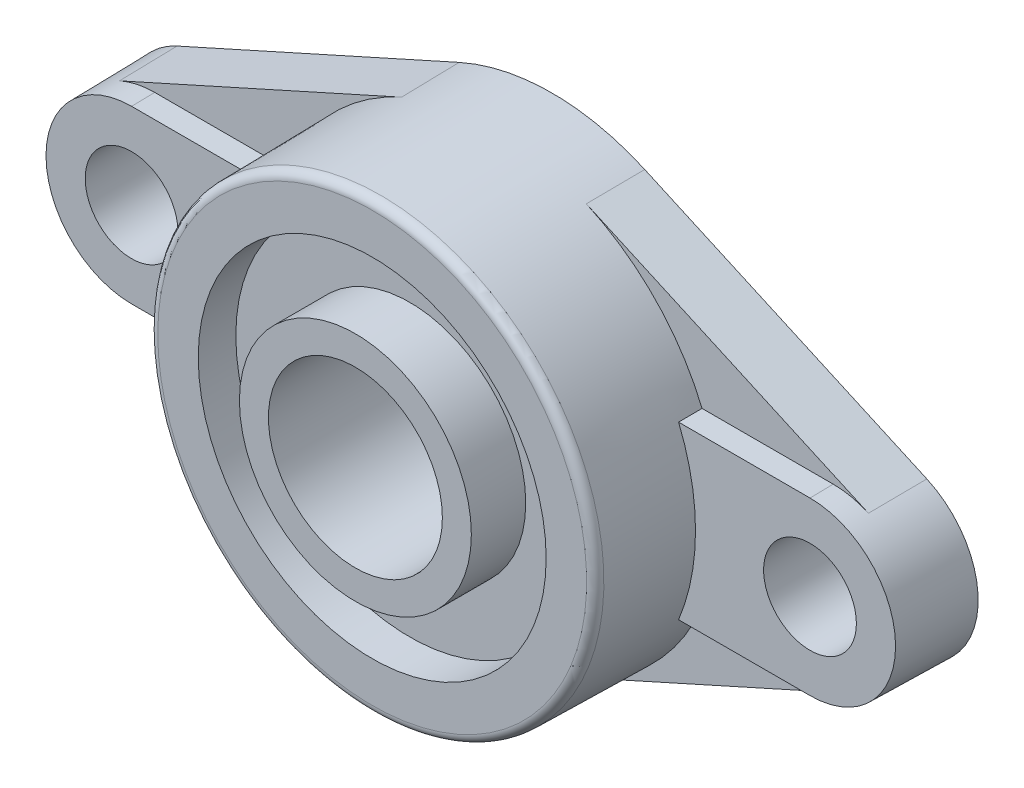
ISO-10303-21;
HEADER;
FILE_DESCRIPTION(('STEP AP214'),'2;1');
FILE_NAME('part.step','',(''),(''),'','','');
FILE_SCHEMA(('AUTOMOTIVE_DESIGN { 1 0 10303 214 1 1 1 1 }'));
ENDSEC;
DATA;
#1=APPLICATION_CONTEXT('core data for automotive mechanical design processes');
#2=APPLICATION_PROTOCOL_DEFINITION('international standard','automotive_design',2000,#1);
#3=PRODUCT_CONTEXT('',#1,'mechanical');
#4=PRODUCT('Part','Part','',(#3));
#5=PRODUCT_RELATED_PRODUCT_CATEGORY('part','',(#4));
#6=PRODUCT_DEFINITION_FORMATION('','',#4);
#7=PRODUCT_DEFINITION_CONTEXT('part definition',#1,'design');
#8=PRODUCT_DEFINITION('design','',#6,#7);
#9=PRODUCT_DEFINITION_SHAPE('','',#8);
#10=(LENGTH_UNIT() NAMED_UNIT(*) SI_UNIT(.MILLI.,.METRE.));
#11=(NAMED_UNIT(*) PLANE_ANGLE_UNIT() SI_UNIT($,.RADIAN.));
#12=(NAMED_UNIT(*) SI_UNIT($,.STERADIAN.) SOLID_ANGLE_UNIT());
#13=UNCERTAINTY_MEASURE_WITH_UNIT(LENGTH_MEASURE(1.E-05),#10,'distance_accuracy_value','');
#14=(GEOMETRIC_REPRESENTATION_CONTEXT(3) GLOBAL_UNCERTAINTY_ASSIGNED_CONTEXT((#13)) GLOBAL_UNIT_ASSIGNED_CONTEXT((#10,
#11,#12)) REPRESENTATION_CONTEXT('',''));
#15=CARTESIAN_POINT('',(0.,0.,0.));
#16=DIRECTION('',(0.,0.,1.));
#17=DIRECTION('',(1.,0.,0.));
#18=AXIS2_PLACEMENT_3D('',#15,#16,#17);
#19=CARTESIAN_POINT('',(0.,15.,33.9));
#20=DIRECTION('',(0.,0.,1.));
#21=DIRECTION('',(1.,0.,0.));
#22=AXIS2_PLACEMENT_3D('',#19,#20,#21);
#23=PLANE('',#22);
#24=CARTESIAN_POINT('',(0.,0.,33.9));
#25=DIRECTION('',(0.,0.,-1.));
#26=DIRECTION('',(-1.,0.,0.));
#27=AXIS2_PLACEMENT_3D('',#24,#25,#26);
#28=CIRCLE('',#27,20.);
#29=CARTESIAN_POINT('',(-20.,0.,33.9));
#30=VERTEX_POINT('',#29);
#31=EDGE_CURVE('E373',#30,#30,#28,.T.);
#32=ORIENTED_EDGE('',*,*,#31,.F.);
#33=EDGE_LOOP('',(#32));
#34=FACE_BOUND('',#33,.T.);
#35=CARTESIAN_POINT('',(0.,0.,33.9));
#36=DIRECTION('',(0.,0.,-1.));
#37=DIRECTION('',(1.,0.,0.));
#38=AXIS2_PLACEMENT_3D('',#35,#36,#37);
#39=CIRCLE('',#38,15.);
#40=CARTESIAN_POINT('',(15.,0.,33.9));
#41=VERTEX_POINT('',#40);
#42=EDGE_CURVE('E465',#41,#41,#39,.T.);
#43=ORIENTED_EDGE('',*,*,#42,.T.);
#44=EDGE_LOOP('',(#43));
#45=FACE_BOUND('',#44,.T.);
#46=ADVANCED_FACE('F17',(#34,#45),#23,.T.);
#47=CARTESIAN_POINT('',(0.,15.,-4.09999999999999));
#48=DIRECTION('',(0.,0.,1.));
#49=DIRECTION('',(1.,0.,0.));
#50=AXIS2_PLACEMENT_3D('',#47,#48,#49);
#51=PLANE('',#50);
#52=CARTESIAN_POINT('',(0.,0.,-4.09999999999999));
#53=DIRECTION('',(0.,0.,-1.));
#54=DIRECTION('',(-1.,0.,0.));
#55=AXIS2_PLACEMENT_3D('',#52,#53,#54);
#56=CIRCLE('',#55,20.);
#57=CARTESIAN_POINT('',(-20.,0.,-4.09999999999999));
#58=VERTEX_POINT('',#57);
#59=EDGE_CURVE('E291',#58,#58,#56,.T.);
#60=ORIENTED_EDGE('',*,*,#59,.T.);
#61=EDGE_LOOP('',(#60));
#62=FACE_BOUND('',#61,.T.);
#63=CARTESIAN_POINT('',(0.,0.,-4.09999999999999));
#64=DIRECTION('',(0.,0.,1.));
#65=DIRECTION('',(1.,0.,0.));
#66=AXIS2_PLACEMENT_3D('',#63,#64,#65);
#67=CIRCLE('',#66,15.);
#68=CARTESIAN_POINT('',(15.,0.,-4.09999999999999));
#69=VERTEX_POINT('',#68);
#70=EDGE_CURVE('E462',#69,#69,#67,.F.);
#71=ORIENTED_EDGE('',*,*,#70,.F.);
#72=EDGE_LOOP('',(#71));
#73=FACE_BOUND('',#72,.T.);
#74=ADVANCED_FACE('F415',(#62,#73),#51,.F.);
#75=CARTESIAN_POINT('',(-58.5,0.,10.));
#76=DIRECTION('',(0.,0.,-1.));
#77=DIRECTION('',(-1.,0.,0.));
#78=AXIS2_PLACEMENT_3D('',#75,#76,#77);
#79=PLANE('',#78);
#80=CARTESIAN_POINT('',(0.,0.,10.));
#81=DIRECTION('',(0.,0.,-1.));
#82=DIRECTION('',(-1.,0.,0.));
#83=AXIS2_PLACEMENT_3D('',#80,#81,#82);
#84=CIRCLE('',#83,38.8254493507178);
#85=CARTESIAN_POINT('',(-15.9283894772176,-35.4076534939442,10.));
#86=VERTEX_POINT('',#85);
#87=CARTESIAN_POINT('',(-35.8834442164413,-14.8254493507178,10.));
#88=VERTEX_POINT('',#87);
#89=EDGE_CURVE('E290',#86,#88,#84,.T.);
#90=ORIENTED_EDGE('',*,*,#89,.T.);
#91=DIRECTION('',(-1.,0.,0.));
#92=VECTOR('',#91,1.);
#93=CARTESIAN_POINT('',(-58.5,-14.8254493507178,10.));
#94=LINE('',#93,#92);
#95=CARTESIAN_POINT('',(-58.5,-14.8254493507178,10.));
#96=VERTEX_POINT('',#95);
#97=EDGE_CURVE('E269',#88,#96,#94,.T.);
#98=ORIENTED_EDGE('',*,*,#97,.T.);
#99=CARTESIAN_POINT('',(-58.5,0.,10.));
#100=DIRECTION('',(0.,0.,-1.));
#101=DIRECTION('',(-1.,0.,0.));
#102=AXIS2_PLACEMENT_3D('',#99,#100,#101);
#103=CIRCLE('',#102,14.8254493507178);
#104=CARTESIAN_POINT('',(-64.5822356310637,-13.5203682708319,10.));
#105=VERTEX_POINT('',#104);
#106=EDGE_CURVE('E138',#96,#105,#103,.T.);
#107=ORIENTED_EDGE('',*,*,#106,.T.);
#108=DIRECTION('',(-0.911970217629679,0.41025641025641,0.));
#109=VECTOR('',#108,1.);
#110=CARTESIAN_POINT('',(-64.5822356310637,-13.5203682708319,10.));
#111=LINE('',#110,#109);
#112=EDGE_CURVE('E249',#86,#105,#111,.T.);
#113=ORIENTED_EDGE('',*,*,#112,.F.);
#114=EDGE_LOOP('',(#90,#98,#107,#113));
#115=FACE_BOUND('',#114,.T.);
#116=ADVANCED_FACE('F370',(#115),#79,.F.);
#117=CARTESIAN_POINT('',(0.,0.,10.));
#118=DIRECTION('',(0.,0.,-1.));
#119=DIRECTION('',(-1.,0.,0.));
#120=AXIS2_PLACEMENT_3D('',#117,#118,#119);
#121=CIRCLE('',#120,38.8254493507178);
#122=CARTESIAN_POINT('',(35.8834442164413,-14.8254493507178,10.));
#123=VERTEX_POINT('',#122);
#124=CARTESIAN_POINT('',(15.9283894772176,-35.4076534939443,10.));
#125=VERTEX_POINT('',#124);
#126=EDGE_CURVE('E263',#123,#125,#121,.T.);
#127=ORIENTED_EDGE('',*,*,#126,.T.);
#128=DIRECTION('',(-0.911970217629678,-0.410256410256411,0.));
#129=VECTOR('',#128,1.);
#130=CARTESIAN_POINT('',(-32.7254566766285,-57.2949387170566,10.));
#131=LINE('',#130,#129);
#132=CARTESIAN_POINT('',(64.5822356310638,-13.5203682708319,10.));
#133=VERTEX_POINT('',#132);
#134=EDGE_CURVE('E273',#133,#125,#131,.T.);
#135=ORIENTED_EDGE('',*,*,#134,.F.);
#136=CARTESIAN_POINT('',(58.5,0.,10.));
#137=DIRECTION('',(0.,0.,-1.));
#138=DIRECTION('',(-1.,0.,0.));
#139=AXIS2_PLACEMENT_3D('',#136,#137,#138);
#140=CIRCLE('',#139,14.8254493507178);
#141=CARTESIAN_POINT('',(58.5,-14.8254493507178,10.));
#142=VERTEX_POINT('',#141);
#143=EDGE_CURVE('E297',#133,#142,#140,.T.);
#144=ORIENTED_EDGE('',*,*,#143,.T.);
#145=DIRECTION('',(-1.,0.,0.));
#146=VECTOR('',#145,1.);
#147=CARTESIAN_POINT('',(-58.5,-14.8254493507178,10.));
#148=LINE('',#147,#146);
#149=EDGE_CURVE('E310',#142,#123,#148,.T.);
#150=ORIENTED_EDGE('',*,*,#149,.T.);
#151=EDGE_LOOP('',(#127,#135,#144,#150));
#152=FACE_BOUND('',#151,.T.);
#153=ADVANCED_FACE('F328',(#152),#79,.F.);
#154=CARTESIAN_POINT('',(0.,0.,10.));
#155=DIRECTION('',(0.,0.,-1.));
#156=DIRECTION('',(-1.,0.,0.));
#157=AXIS2_PLACEMENT_3D('',#154,#155,#156);
#158=CIRCLE('',#157,38.8254493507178);
#159=CARTESIAN_POINT('',(15.9283894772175,35.4076534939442,10.));
#160=VERTEX_POINT('',#159);
#161=CARTESIAN_POINT('',(35.8834442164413,14.8254493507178,10.));
#162=VERTEX_POINT('',#161);
#163=EDGE_CURVE('E34',#160,#162,#158,.T.);
#164=ORIENTED_EDGE('',*,*,#163,.T.);
#165=DIRECTION('',(1.,0.,0.));
#166=VECTOR('',#165,1.);
#167=CARTESIAN_POINT('',(-58.5,14.8254493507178,10.));
#168=LINE('',#167,#166);
#169=CARTESIAN_POINT('',(58.5,14.8254493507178,10.));
#170=VERTEX_POINT('',#169);
#171=EDGE_CURVE('E243',#162,#170,#168,.T.);
#172=ORIENTED_EDGE('',*,*,#171,.T.);
#173=CARTESIAN_POINT('',(58.5,0.,10.));
#174=DIRECTION('',(0.,0.,-1.));
#175=DIRECTION('',(-1.,0.,0.));
#176=AXIS2_PLACEMENT_3D('',#173,#174,#175);
#177=CIRCLE('',#176,14.8254493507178);
#178=CARTESIAN_POINT('',(64.5822356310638,13.5203682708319,10.));
#179=VERTEX_POINT('',#178);
#180=EDGE_CURVE('E146',#170,#179,#177,.T.);
#181=ORIENTED_EDGE('',*,*,#180,.T.);
#182=DIRECTION('',(0.911970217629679,-0.41025641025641,0.));
#183=VECTOR('',#182,1.);
#184=CARTESIAN_POINT('',(-32.7254566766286,57.2949387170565,10.));
#185=LINE('',#184,#183);
#186=EDGE_CURVE('E270',#160,#179,#185,.T.);
#187=ORIENTED_EDGE('',*,*,#186,.F.);
#188=EDGE_LOOP('',(#164,#172,#181,#187));
#189=FACE_BOUND('',#188,.T.);
#190=ADVANCED_FACE('F345',(#189),#79,.F.);
#191=CARTESIAN_POINT('',(0.,0.,10.));
#192=DIRECTION('',(0.,0.,-1.));
#193=DIRECTION('',(-1.,0.,0.));
#194=AXIS2_PLACEMENT_3D('',#191,#192,#193);
#195=CIRCLE('',#194,38.8254493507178);
#196=CARTESIAN_POINT('',(-35.8834442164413,14.8254493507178,10.));
#197=VERTEX_POINT('',#196);
#198=CARTESIAN_POINT('',(-15.9283894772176,35.4076534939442,10.));
#199=VERTEX_POINT('',#198);
#200=EDGE_CURVE('E288',#197,#199,#195,.T.);
#201=ORIENTED_EDGE('',*,*,#200,.T.);
#202=DIRECTION('',(0.911970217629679,0.41025641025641,0.));
#203=VECTOR('',#202,1.);
#204=CARTESIAN_POINT('',(-64.5822356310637,13.5203682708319,10.));
#205=LINE('',#204,#203);
#206=CARTESIAN_POINT('',(-64.5822356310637,13.5203682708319,10.));
#207=VERTEX_POINT('',#206);
#208=EDGE_CURVE('E274',#207,#199,#205,.T.);
#209=ORIENTED_EDGE('',*,*,#208,.F.);
#210=CARTESIAN_POINT('',(-58.5,0.,10.));
#211=DIRECTION('',(0.,0.,-1.));
#212=DIRECTION('',(-1.,0.,0.));
#213=AXIS2_PLACEMENT_3D('',#210,#211,#212);
#214=CIRCLE('',#213,14.8254493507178);
#215=CARTESIAN_POINT('',(-58.5,14.8254493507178,10.));
#216=VERTEX_POINT('',#215);
#217=EDGE_CURVE('E245',#207,#216,#214,.T.);
#218=ORIENTED_EDGE('',*,*,#217,.T.);
#219=DIRECTION('',(1.,0.,0.));
#220=VECTOR('',#219,1.);
#221=CARTESIAN_POINT('',(-58.5,14.8254493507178,10.));
#222=LINE('',#221,#220);
#223=EDGE_CURVE('E266',#216,#197,#222,.T.);
#224=ORIENTED_EDGE('',*,*,#223,.T.);
#225=EDGE_LOOP('',(#201,#209,#218,#224));
#226=FACE_BOUND('',#225,.T.);
#227=ADVANCED_FACE('F355',(#226),#79,.F.);
#228=CARTESIAN_POINT('',(-58.5,0.,0.));
#229=DIRECTION('',(0.,0.,-1.));
#230=DIRECTION('',(-1.,0.,0.));
#231=AXIS2_PLACEMENT_3D('',#228,#229,#230);
#232=PLANE('',#231);
#233=CARTESIAN_POINT('',(58.5,0.,0.));
#234=DIRECTION('',(0.,0.,1.));
#235=DIRECTION('',(1.,0.,0.));
#236=AXIS2_PLACEMENT_3D('',#233,#234,#235);
#237=CIRCLE('',#236,8.);
#238=CARTESIAN_POINT('',(66.5,0.,0.));
#239=VERTEX_POINT('',#238);
#240=EDGE_CURVE('E172',#239,#239,#237,.T.);
#241=ORIENTED_EDGE('',*,*,#240,.T.);
#242=EDGE_LOOP('',(#241));
#243=FACE_BOUND('',#242,.T.);
#244=CARTESIAN_POINT('',(-58.5,0.,0.));
#245=DIRECTION('',(0.,0.,-1.));
#246=DIRECTION('',(1.,0.,0.));
#247=AXIS2_PLACEMENT_3D('',#244,#245,#246);
#248=CIRCLE('',#247,15.);
#249=CARTESIAN_POINT('',(-64.6538461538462,-13.6795532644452,0.));
#250=VERTEX_POINT('',#249);
#251=CARTESIAN_POINT('',(-64.6538461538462,13.6795532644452,0.));
#252=VERTEX_POINT('',#251);
#253=EDGE_CURVE('E147',#250,#252,#248,.T.);
#254=ORIENTED_EDGE('',*,*,#253,.T.);
#255=DIRECTION('',(0.911970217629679,0.41025641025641,0.));
#256=VECTOR('',#255,1.);
#257=CARTESIAN_POINT('',(-64.6538461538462,13.6795532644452,0.));
#258=LINE('',#257,#256);
#259=CARTESIAN_POINT('',(-16.,35.5668384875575,0.));
#260=VERTEX_POINT('',#259);
#261=EDGE_CURVE('E188',#252,#260,#258,.T.);
#262=ORIENTED_EDGE('',*,*,#261,.T.);
#263=CARTESIAN_POINT('',(0.,0.,0.));
#264=DIRECTION('',(0.,0.,-1.));
#265=DIRECTION('',(1.,0.,0.));
#266=AXIS2_PLACEMENT_3D('',#263,#264,#265);
#267=CIRCLE('',#266,39.);
#268=CARTESIAN_POINT('',(16.,35.5668384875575,0.));
#269=VERTEX_POINT('',#268);
#270=EDGE_CURVE('E189',#260,#269,#267,.T.);
#271=ORIENTED_EDGE('',*,*,#270,.T.);
#272=DIRECTION('',(0.911970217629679,-0.41025641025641,0.));
#273=VECTOR('',#272,1.);
#274=CARTESIAN_POINT('',(-32.6538461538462,57.4541237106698,0.));
#275=LINE('',#274,#273);
#276=CARTESIAN_POINT('',(64.6538461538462,13.6795532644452,0.));
#277=VERTEX_POINT('',#276);
#278=EDGE_CURVE('E179',#269,#277,#275,.T.);
#279=ORIENTED_EDGE('',*,*,#278,.T.);
#280=CARTESIAN_POINT('',(58.5,0.,0.));
#281=DIRECTION('',(0.,0.,-1.));
#282=DIRECTION('',(-1.,0.,0.));
#283=AXIS2_PLACEMENT_3D('',#280,#281,#282);
#284=CIRCLE('',#283,15.);
#285=CARTESIAN_POINT('',(64.6538461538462,-13.6795532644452,0.));
#286=VERTEX_POINT('',#285);
#287=EDGE_CURVE('E174',#277,#286,#284,.T.);
#288=ORIENTED_EDGE('',*,*,#287,.T.);
#289=DIRECTION('',(-0.911970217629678,-0.410256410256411,0.));
#290=VECTOR('',#289,1.);
#291=CARTESIAN_POINT('',(-32.653846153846,-57.4541237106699,0.));
#292=LINE('',#291,#290);
#293=CARTESIAN_POINT('',(16.0000000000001,-35.5668384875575,0.));
#294=VERTEX_POINT('',#293);
#295=EDGE_CURVE('E178',#286,#294,#292,.T.);
#296=ORIENTED_EDGE('',*,*,#295,.T.);
#297=CARTESIAN_POINT('',(0.,0.,0.));
#298=DIRECTION('',(0.,0.,-1.));
#299=DIRECTION('',(1.,0.,0.));
#300=AXIS2_PLACEMENT_3D('',#297,#298,#299);
#301=CIRCLE('',#300,39.);
#302=CARTESIAN_POINT('',(-16.,-35.5668384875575,0.));
#303=VERTEX_POINT('',#302);
#304=EDGE_CURVE('E180',#294,#303,#301,.T.);
#305=ORIENTED_EDGE('',*,*,#304,.T.);
#306=DIRECTION('',(-0.911970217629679,0.41025641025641,0.));
#307=VECTOR('',#306,1.);
#308=CARTESIAN_POINT('',(-64.6538461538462,-13.6795532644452,0.));
#309=LINE('',#308,#307);
#310=EDGE_CURVE('E184',#303,#250,#309,.T.);
#311=ORIENTED_EDGE('',*,*,#310,.T.);
#312=EDGE_LOOP('',(#254,#262,#271,#279,#288,#296,#305,#311));
#313=FACE_BOUND('',#312,.T.);
#314=CARTESIAN_POINT('',(-58.5,0.,0.));
#315=DIRECTION('',(0.,0.,1.));
#316=DIRECTION('',(1.,0.,0.));
#317=AXIS2_PLACEMENT_3D('',#314,#315,#316);
#318=CIRCLE('',#317,8.00000000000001);
#319=CARTESIAN_POINT('',(-50.5,0.,0.));
#320=VERTEX_POINT('',#319);
#321=EDGE_CURVE('E284',#320,#320,#318,.T.);
#322=ORIENTED_EDGE('',*,*,#321,.T.);
#323=EDGE_LOOP('',(#322));
#324=FACE_BOUND('',#323,.T.);
#325=CARTESIAN_POINT('',(0.,0.,0.));
#326=DIRECTION('',(0.,0.,-1.));
#327=DIRECTION('',(-1.,0.,0.));
#328=AXIS2_PLACEMENT_3D('',#325,#326,#327);
#329=CIRCLE('',#328,20.);
#330=CARTESIAN_POINT('',(-20.,0.,0.));
#331=VERTEX_POINT('',#330);
#332=EDGE_CURVE('E161',#331,#331,#329,.F.);
#333=ORIENTED_EDGE('',*,*,#332,.T.);
#334=EDGE_LOOP('',(#333));
#335=FACE_BOUND('',#334,.T.);
#336=ADVANCED_FACE('F340',(#243,#313,#324,#335),#232,.T.);
#337=CARTESIAN_POINT('',(0.,15.,0.));
#338=DIRECTION('',(0.,0.999847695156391,0.0174524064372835));
#339=DIRECTION('',(0.,-0.0174524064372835,0.999847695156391));
#340=AXIS2_PLACEMENT_3D('',#337,#338,#339);
#341=PLANE('',#340);
#342=ORIENTED_EDGE('',*,*,#171,.F.);
#343=CARTESIAN_POINT('',(35.8834442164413,14.8254493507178,10.));
#344=CARTESIAN_POINT('',(35.8756612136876,14.8138126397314,10.6666667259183));
#345=CARTESIAN_POINT('',(35.8678756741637,14.8021759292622,11.3333334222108));
#346=CARTESIAN_POINT('',(35.8522995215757,14.7789025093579,12.6666667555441));
#347=CARTESIAN_POINT('',(35.8445089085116,14.7672657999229,13.3333333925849));
#348=CARTESIAN_POINT('',(35.8367157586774,14.755629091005,14.));
#349=B_SPLINE_CURVE_WITH_KNOTS('',3,(#343,#344,#345,#346,#347,#348),.UNSPECIFIED.,.F.,.F.,(4,2,
4),(0.,2.00044110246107,4.00088220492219),.UNSPECIFIED.);
#350=CARTESIAN_POINT('',(35.8367157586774,14.755629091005,14.));
#351=VERTEX_POINT('',#350);
#352=EDGE_CURVE('E133',#162,#351,#349,.T.);
#353=ORIENTED_EDGE('',*,*,#352,.T.);
#354=DIRECTION('',(1.,0.,0.));
#355=VECTOR('',#354,1.);
#356=CARTESIAN_POINT('',(58.5,14.755629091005,14.));
#357=LINE('',#356,#355);
#358=CARTESIAN_POINT('',(58.5,14.755629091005,14.));
#359=VERTEX_POINT('',#358);
#360=EDGE_CURVE('E127',#351,#359,#357,.T.);
#361=ORIENTED_EDGE('',*,*,#360,.T.);
#362=DIRECTION('',(0.,0.0174524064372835,-0.999847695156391));
#363=VECTOR('',#362,1.);
#364=CARTESIAN_POINT('',(58.5,15.,0.));
#365=LINE('',#364,#363);
#366=EDGE_CURVE('E130',#359,#170,#365,.T.);
#367=ORIENTED_EDGE('',*,*,#366,.T.);
#368=EDGE_LOOP('',(#342,#353,#361,#367));
#369=FACE_BOUND('',#368,.T.);
#370=ADVANCED_FACE('F129',(#369),#341,.T.);
#371=CARTESIAN_POINT('',(0.,15.,0.));
#372=DIRECTION('',(0.,0.999847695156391,0.0174524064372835));
#373=DIRECTION('',(0.,-0.0174524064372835,0.999847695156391));
#374=AXIS2_PLACEMENT_3D('',#371,#372,#373);
#375=PLANE('',#374);
#376=DIRECTION('',(1.,0.,0.));
#377=VECTOR('',#376,1.);
#378=CARTESIAN_POINT('',(58.5,14.755629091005,14.));
#379=LINE('',#378,#377);
#380=CARTESIAN_POINT('',(-58.5,14.755629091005,14.));
#381=VERTEX_POINT('',#380);
#382=CARTESIAN_POINT('',(-35.8367157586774,14.755629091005,14.));
#383=VERTEX_POINT('',#382);
#384=EDGE_CURVE('E137',#381,#383,#379,.T.);
#385=ORIENTED_EDGE('',*,*,#384,.T.);
#386=CARTESIAN_POINT('',(-35.8367157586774,14.755629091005,14.));
#387=CARTESIAN_POINT('',(-35.8445089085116,14.7672657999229,13.3333333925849));
#388=CARTESIAN_POINT('',(-35.8522995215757,14.7789025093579,12.6666667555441));
#389=CARTESIAN_POINT('',(-35.8678756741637,14.8021759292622,11.3333334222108));
#390=CARTESIAN_POINT('',(-35.8756612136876,14.8138126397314,10.6666667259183));
#391=CARTESIAN_POINT('',(-35.8834442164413,14.8254493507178,10.));
#392=B_SPLINE_CURVE_WITH_KNOTS('',3,(#386,#387,#388,#389,#390,#391),.UNSPECIFIED.,.F.,.F.,(4,2,
4),(0.,2.00044110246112,4.00088220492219),.UNSPECIFIED.);
#393=EDGE_CURVE('E199',#383,#197,#392,.T.);
#394=ORIENTED_EDGE('',*,*,#393,.T.);
#395=ORIENTED_EDGE('',*,*,#223,.F.);
#396=DIRECTION('',(0.,0.0174524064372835,-0.999847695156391));
#397=VECTOR('',#396,1.);
#398=CARTESIAN_POINT('',(-58.5,15.,0.));
#399=LINE('',#398,#397);
#400=EDGE_CURVE('E253',#381,#216,#399,.T.);
#401=ORIENTED_EDGE('',*,*,#400,.F.);
#402=EDGE_LOOP('',(#385,#394,#395,#401));
#403=FACE_BOUND('',#402,.T.);
#404=ADVANCED_FACE('F216',(#403),#375,.T.);
#405=CARTESIAN_POINT('',(0.,-15.,0.));
#406=DIRECTION('',(0.,-0.999847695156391,0.0174524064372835));
#407=DIRECTION('',(0.,-0.0174524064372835,-0.999847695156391));
#408=AXIS2_PLACEMENT_3D('',#405,#406,#407);
#409=PLANE('',#408);
#410=ORIENTED_EDGE('',*,*,#97,.F.);
#411=CARTESIAN_POINT('',(-35.8834442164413,-14.8254493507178,10.));
#412=CARTESIAN_POINT('',(-35.8756612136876,-14.8138126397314,10.6666667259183));
#413=CARTESIAN_POINT('',(-35.8678756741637,-14.8021759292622,11.3333334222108));
#414=CARTESIAN_POINT('',(-35.8522995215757,-14.7789025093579,12.6666667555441));
#415=CARTESIAN_POINT('',(-35.8445089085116,-14.7672657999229,13.3333333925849));
#416=CARTESIAN_POINT('',(-35.8367157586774,-14.755629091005,14.));
#417=B_SPLINE_CURVE_WITH_KNOTS('',3,(#411,#412,#413,#414,#415,#416),.UNSPECIFIED.,.F.,.F.,(4,2,
4),(0.,2.00044110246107,4.00088220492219),.UNSPECIFIED.);
#418=CARTESIAN_POINT('',(-35.8367157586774,-14.755629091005,14.));
#419=VERTEX_POINT('',#418);
#420=EDGE_CURVE('E207',#88,#419,#417,.T.);
#421=ORIENTED_EDGE('',*,*,#420,.T.);
#422=DIRECTION('',(-1.,0.,0.));
#423=VECTOR('',#422,1.);
#424=CARTESIAN_POINT('',(58.5,-14.755629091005,14.));
#425=LINE('',#424,#423);
#426=CARTESIAN_POINT('',(-58.5,-14.755629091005,14.));
#427=VERTEX_POINT('',#426);
#428=EDGE_CURVE('E153',#419,#427,#425,.T.);
#429=ORIENTED_EDGE('',*,*,#428,.T.);
#430=DIRECTION('',(0.,-0.0174524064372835,-0.999847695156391));
#431=VECTOR('',#430,1.);
#432=CARTESIAN_POINT('',(-58.5,-15.,0.));
#433=LINE('',#432,#431);
#434=EDGE_CURVE('E250',#427,#96,#433,.T.);
#435=ORIENTED_EDGE('',*,*,#434,.T.);
#436=EDGE_LOOP('',(#410,#421,#429,#435));
#437=FACE_BOUND('',#436,.T.);
#438=ADVANCED_FACE('F219',(#437),#409,.T.);
#439=CARTESIAN_POINT('',(0.,-15.,0.));
#440=DIRECTION('',(0.,-0.999847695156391,0.0174524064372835));
#441=DIRECTION('',(0.,-0.0174524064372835,-0.999847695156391));
#442=AXIS2_PLACEMENT_3D('',#439,#440,#441);
#443=PLANE('',#442);
#444=DIRECTION('',(-1.,0.,0.));
#445=VECTOR('',#444,1.);
#446=CARTESIAN_POINT('',(58.5,-14.755629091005,14.));
#447=LINE('',#446,#445);
#448=CARTESIAN_POINT('',(58.5,-14.755629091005,14.));
#449=VERTEX_POINT('',#448);
#450=CARTESIAN_POINT('',(35.8367157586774,-14.755629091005,14.));
#451=VERTEX_POINT('',#450);
#452=EDGE_CURVE('E152',#449,#451,#447,.T.);
#453=ORIENTED_EDGE('',*,*,#452,.T.);
#454=CARTESIAN_POINT('',(35.8367157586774,-14.755629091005,14.));
#455=CARTESIAN_POINT('',(35.8445089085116,-14.7672657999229,13.3333333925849));
#456=CARTESIAN_POINT('',(35.8522995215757,-14.7789025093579,12.6666667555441));
#457=CARTESIAN_POINT('',(35.8678756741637,-14.8021759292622,11.3333334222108));
#458=CARTESIAN_POINT('',(35.8756612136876,-14.8138126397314,10.6666667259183));
#459=CARTESIAN_POINT('',(35.8834442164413,-14.8254493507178,10.));
#460=B_SPLINE_CURVE_WITH_KNOTS('',3,(#454,#455,#456,#457,#458,#459),.UNSPECIFIED.,.F.,.F.,(4,2,
4),(0.,2.00044110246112,4.00088220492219),.UNSPECIFIED.);
#461=EDGE_CURVE('E206',#451,#123,#460,.T.);
#462=ORIENTED_EDGE('',*,*,#461,.T.);
#463=ORIENTED_EDGE('',*,*,#149,.F.);
#464=DIRECTION('',(0.,-0.0174524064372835,-0.999847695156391));
#465=VECTOR('',#464,1.);
#466=CARTESIAN_POINT('',(58.5,-15.,0.));
#467=LINE('',#466,#465);
#468=EDGE_CURVE('E148',#449,#142,#467,.T.);
#469=ORIENTED_EDGE('',*,*,#468,.F.);
#470=EDGE_LOOP('',(#453,#462,#463,#469));
#471=FACE_BOUND('',#470,.T.);
#472=ADVANCED_FACE('F224',(#471),#443,.T.);
#473=CARTESIAN_POINT('',(58.5,0.,14.));
#474=DIRECTION('',(0.,0.,-1.));
#475=DIRECTION('',(-1.,0.,0.));
#476=AXIS2_PLACEMENT_3D('',#473,#474,#475);
#477=PLANE('',#476);
#478=CARTESIAN_POINT('',(58.5,0.,14.));
#479=DIRECTION('',(0.,0.,1.));
#480=DIRECTION('',(1.,0.,0.));
#481=AXIS2_PLACEMENT_3D('',#478,#479,#480);
#482=CIRCLE('',#481,8.);
#483=CARTESIAN_POINT('',(66.5,0.,14.));
#484=VERTEX_POINT('',#483);
#485=EDGE_CURVE('E256',#484,#484,#482,.T.);
#486=ORIENTED_EDGE('',*,*,#485,.F.);
#487=EDGE_LOOP('',(#486));
#488=FACE_BOUND('',#487,.T.);
#489=CARTESIAN_POINT('',(0.,0.,14.));
#490=DIRECTION('',(0.,0.,-1.));
#491=DIRECTION('',(-1.,0.,0.));
#492=AXIS2_PLACEMENT_3D('',#489,#490,#491);
#493=CIRCLE('',#492,38.755629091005);
#494=EDGE_CURVE('E165',#451,#351,#493,.F.);
#495=ORIENTED_EDGE('',*,*,#494,.F.);
#496=ORIENTED_EDGE('',*,*,#452,.F.);
#497=CARTESIAN_POINT('',(58.5,0.,14.));
#498=DIRECTION('',(0.,0.,-1.));
#499=DIRECTION('',(-1.,0.,0.));
#500=AXIS2_PLACEMENT_3D('',#497,#498,#499);
#501=CIRCLE('',#500,14.755629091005);
#502=EDGE_CURVE('E143',#359,#449,#501,.T.);
#503=ORIENTED_EDGE('',*,*,#502,.F.);
#504=ORIENTED_EDGE('',*,*,#360,.F.);
#505=EDGE_LOOP('',(#495,#496,#503,#504));
#506=FACE_BOUND('',#505,.T.);
#507=ADVANCED_FACE('F150',(#488,#506),#477,.F.);
#508=CARTESIAN_POINT('',(-58.5,0.,14.));
#509=DIRECTION('',(0.,0.,1.));
#510=DIRECTION('',(1.,0.,0.));
#511=AXIS2_PLACEMENT_3D('',#508,#509,#510);
#512=CIRCLE('',#511,8.00000000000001);
#513=CARTESIAN_POINT('',(-50.5,0.,14.));
#514=VERTEX_POINT('',#513);
#515=EDGE_CURVE('E305',#514,#514,#512,.T.);
#516=ORIENTED_EDGE('',*,*,#515,.F.);
#517=EDGE_LOOP('',(#516));
#518=FACE_BOUND('',#517,.T.);
#519=CARTESIAN_POINT('',(0.,0.,14.));
#520=DIRECTION('',(0.,0.,-1.));
#521=DIRECTION('',(-1.,0.,0.));
#522=AXIS2_PLACEMENT_3D('',#519,#520,#521);
#523=CIRCLE('',#522,38.755629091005);
#524=EDGE_CURVE('E169',#383,#419,#523,.F.);
#525=ORIENTED_EDGE('',*,*,#524,.F.);
#526=ORIENTED_EDGE('',*,*,#384,.F.);
#527=CARTESIAN_POINT('',(-58.5,0.,14.));
#528=DIRECTION('',(0.,0.,-1.));
#529=DIRECTION('',(-1.,0.,0.));
#530=AXIS2_PLACEMENT_3D('',#527,#528,#529);
#531=CIRCLE('',#530,14.755629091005);
#532=EDGE_CURVE('E303',#427,#381,#531,.T.);
#533=ORIENTED_EDGE('',*,*,#532,.F.);
#534=ORIENTED_EDGE('',*,*,#428,.F.);
#535=EDGE_LOOP('',(#525,#526,#533,#534));
#536=FACE_BOUND('',#535,.T.);
#537=ADVANCED_FACE('F361',(#518,#536),#477,.F.);
#538=CARTESIAN_POINT('',(-58.5,0.,0.));
#539=DIRECTION('',(0.,0.,-1.));
#540=DIRECTION('',(1.,0.,0.));
#541=AXIS2_PLACEMENT_3D('',#538,#539,#540);
#542=CONICAL_SURFACE('',#541,15.,0.0174532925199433);
#543=ORIENTED_EDGE('',*,*,#253,.F.);
#544=DIRECTION('',(-0.0071599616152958,-0.0159160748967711,-0.999847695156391));
#545=VECTOR('',#544,1.);
#546=CARTESIAN_POINT('',(-64.6538461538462,-13.6795532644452,0.));
#547=LINE('',#546,#545);
#548=EDGE_CURVE('E246',#105,#250,#547,.T.);
#549=ORIENTED_EDGE('',*,*,#548,.F.);
#550=ORIENTED_EDGE('',*,*,#106,.F.);
#551=ORIENTED_EDGE('',*,*,#434,.F.);
#552=ORIENTED_EDGE('',*,*,#532,.T.);
#553=ORIENTED_EDGE('',*,*,#400,.T.);
#554=ORIENTED_EDGE('',*,*,#217,.F.);
#555=DIRECTION('',(-0.0071599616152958,0.0159160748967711,-0.999847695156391));
#556=VECTOR('',#555,1.);
#557=CARTESIAN_POINT('',(-64.6538461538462,13.6795532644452,0.));
#558=LINE('',#557,#556);
#559=EDGE_CURVE('E198',#207,#252,#558,.T.);
#560=ORIENTED_EDGE('',*,*,#559,.T.);
#561=EDGE_LOOP('',(#543,#549,#550,#551,#552,#553,#554,#560));
#562=FACE_BOUND('',#561,.T.);
#563=ADVANCED_FACE('F367',(#562),#542,.T.);
#564=CARTESIAN_POINT('',(-16.,35.5668384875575,0.));
#565=DIRECTION('',(-0.410193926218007,0.911831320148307,0.0174524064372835));
#566=DIRECTION('',(-0.911970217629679,-0.41025641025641,0.));
#567=AXIS2_PLACEMENT_3D('',#564,#565,#566);
#568=PLANE('',#567);
#569=ORIENTED_EDGE('',*,*,#261,.F.);
#570=ORIENTED_EDGE('',*,*,#559,.F.);
#571=ORIENTED_EDGE('',*,*,#208,.T.);
#572=DIRECTION('',(-0.0071599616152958,0.0159160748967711,-0.999847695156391));
#573=VECTOR('',#572,1.);
#574=CARTESIAN_POINT('',(-16.,35.5668384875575,0.));
#575=LINE('',#574,#573);
#576=EDGE_CURVE('E195',#199,#260,#575,.T.);
#577=ORIENTED_EDGE('',*,*,#576,.T.);
#578=EDGE_LOOP('',(#569,#570,#571,#577));
#579=FACE_BOUND('',#578,.T.);
#580=ADVANCED_FACE('F352',(#579),#568,.T.);
#581=CARTESIAN_POINT('',(16.,35.5668384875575,0.));
#582=DIRECTION('',(0.410193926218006,0.911831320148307,0.0174524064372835));
#583=DIRECTION('',(-0.911970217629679,0.41025641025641,0.));
#584=AXIS2_PLACEMENT_3D('',#581,#582,#583);
#585=PLANE('',#584);
#586=ORIENTED_EDGE('',*,*,#278,.F.);
#587=DIRECTION('',(0.00715996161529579,0.0159160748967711,-0.999847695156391));
#588=VECTOR('',#587,1.);
#589=CARTESIAN_POINT('',(16.,35.5668384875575,0.));
#590=LINE('',#589,#588);
#591=EDGE_CURVE('E193',#160,#269,#590,.T.);
#592=ORIENTED_EDGE('',*,*,#591,.F.);
#593=ORIENTED_EDGE('',*,*,#186,.T.);
#594=DIRECTION('',(0.00715996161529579,0.0159160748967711,-0.999847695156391));
#595=VECTOR('',#594,1.);
#596=CARTESIAN_POINT('',(64.6538461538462,13.6795532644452,0.));
#597=LINE('',#596,#595);
#598=EDGE_CURVE('E196',#179,#277,#597,.T.);
#599=ORIENTED_EDGE('',*,*,#598,.T.);
#600=EDGE_LOOP('',(#586,#592,#593,#599));
#601=FACE_BOUND('',#600,.T.);
#602=ADVANCED_FACE('F344',(#601),#585,.T.);
#603=CARTESIAN_POINT('',(58.5,0.,0.));
#604=DIRECTION('',(0.,0.,-1.));
#605=DIRECTION('',(1.,0.,0.));
#606=AXIS2_PLACEMENT_3D('',#603,#604,#605);
#607=CONICAL_SURFACE('',#606,15.,0.0174532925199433);
#608=ORIENTED_EDGE('',*,*,#287,.F.);
#609=ORIENTED_EDGE('',*,*,#598,.F.);
#610=ORIENTED_EDGE('',*,*,#180,.F.);
#611=ORIENTED_EDGE('',*,*,#366,.F.);
#612=ORIENTED_EDGE('',*,*,#502,.T.);
#613=ORIENTED_EDGE('',*,*,#468,.T.);
#614=ORIENTED_EDGE('',*,*,#143,.F.);
#615=DIRECTION('',(0.00715996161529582,-0.015916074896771,-0.999847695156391));
#616=VECTOR('',#615,1.);
#617=CARTESIAN_POINT('',(64.6538461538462,-13.6795532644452,0.));
#618=LINE('',#617,#616);
#619=EDGE_CURVE('E258',#133,#286,#618,.T.);
#620=ORIENTED_EDGE('',*,*,#619,.T.);
#621=EDGE_LOOP('',(#608,#609,#610,#611,#612,#613,#614,#620));
#622=FACE_BOUND('',#621,.T.);
#623=ADVANCED_FACE('F19',(#622),#607,.T.);
#624=CARTESIAN_POINT('',(16.0000000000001,-35.5668384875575,0.));
#625=DIRECTION('',(0.410193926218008,-0.911831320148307,0.0174524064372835));
#626=DIRECTION('',(0.911970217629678,0.410256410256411,0.));
#627=AXIS2_PLACEMENT_3D('',#624,#625,#626);
#628=PLANE('',#627);
#629=ORIENTED_EDGE('',*,*,#295,.F.);
#630=ORIENTED_EDGE('',*,*,#619,.F.);
#631=ORIENTED_EDGE('',*,*,#134,.T.);
#632=DIRECTION('',(0.00715996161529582,-0.015916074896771,-0.999847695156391));
#633=VECTOR('',#632,1.);
#634=CARTESIAN_POINT('',(16.0000000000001,-35.5668384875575,0.));
#635=LINE('',#634,#633);
#636=EDGE_CURVE('E238',#125,#294,#635,.T.);
#637=ORIENTED_EDGE('',*,*,#636,.T.);
#638=EDGE_LOOP('',(#629,#630,#631,#637));
#639=FACE_BOUND('',#638,.T.);
#640=ADVANCED_FACE('F337',(#639),#628,.T.);
#641=CARTESIAN_POINT('',(0.,0.,0.));
#642=DIRECTION('',(0.,0.,-1.));
#643=DIRECTION('',(1.,0.,0.));
#644=AXIS2_PLACEMENT_3D('',#641,#642,#643);
#645=CONICAL_SURFACE('',#644,39.,0.0174532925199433);
#646=CARTESIAN_POINT('',(0.,0.,29.5261786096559));
#647=DIRECTION('',(0.,0.,-1.));
#648=DIRECTION('',(-1.,0.,0.));
#649=AXIS2_PLACEMENT_3D('',#646,#647,#648);
#650=CIRCLE('',#649,38.4846186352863);
#651=CARTESIAN_POINT('',(-38.4846186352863,0.,29.5261786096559));
#652=VERTEX_POINT('',#651);
#653=EDGE_CURVE('E26',#652,#652,#650,.T.);
#654=ORIENTED_EDGE('',*,*,#653,.T.);
#655=EDGE_LOOP('',(#654));
#656=FACE_BOUND('',#655,.T.);
#657=ORIENTED_EDGE('',*,*,#163,.F.);
#658=ORIENTED_EDGE('',*,*,#591,.T.);
#659=ORIENTED_EDGE('',*,*,#270,.F.);
#660=ORIENTED_EDGE('',*,*,#576,.F.);
#661=ORIENTED_EDGE('',*,*,#200,.F.);
#662=ORIENTED_EDGE('',*,*,#393,.F.);
#663=ORIENTED_EDGE('',*,*,#524,.T.);
#664=ORIENTED_EDGE('',*,*,#420,.F.);
#665=ORIENTED_EDGE('',*,*,#89,.F.);
#666=DIRECTION('',(-0.0071599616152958,-0.015916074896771,-0.999847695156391));
#667=VECTOR('',#666,1.);
#668=CARTESIAN_POINT('',(-16.,-35.5668384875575,0.));
#669=LINE('',#668,#667);
#670=EDGE_CURVE('E248',#86,#303,#669,.T.);
#671=ORIENTED_EDGE('',*,*,#670,.T.);
#672=ORIENTED_EDGE('',*,*,#304,.F.);
#673=ORIENTED_EDGE('',*,*,#636,.F.);
#674=ORIENTED_EDGE('',*,*,#126,.F.);
#675=ORIENTED_EDGE('',*,*,#461,.F.);
#676=ORIENTED_EDGE('',*,*,#494,.T.);
#677=ORIENTED_EDGE('',*,*,#352,.F.);
#678=EDGE_LOOP('',(#657,#658,#659,#660,#661,#662,#663,#664,#665,#671,#672,#673,#674,#675,#676,#677));
#679=FACE_BOUND('',#678,.T.);
#680=ADVANCED_FACE('F213',(#656,#679),#645,.T.);
#681=CARTESIAN_POINT('',(-16.,-35.5668384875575,0.));
#682=DIRECTION('',(-0.410193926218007,-0.911831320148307,0.0174524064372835));
#683=DIRECTION('',(0.911970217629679,-0.41025641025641,0.));
#684=AXIS2_PLACEMENT_3D('',#681,#682,#683);
#685=PLANE('',#684);
#686=ORIENTED_EDGE('',*,*,#310,.F.);
#687=ORIENTED_EDGE('',*,*,#670,.F.);
#688=ORIENTED_EDGE('',*,*,#112,.T.);
#689=ORIENTED_EDGE('',*,*,#548,.T.);
#690=EDGE_LOOP('',(#686,#687,#688,#689));
#691=FACE_BOUND('',#690,.T.);
#692=ADVANCED_FACE('F522',(#691),#685,.T.);
#693=CARTESIAN_POINT('',(-58.5,0.,10.));
#694=DIRECTION('',(0.,0.,-1.));
#695=DIRECTION('',(-1.,0.,0.));
#696=AXIS2_PLACEMENT_3D('',#693,#694,#695);
#697=CYLINDRICAL_SURFACE('',#696,8.00000000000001);
#698=ORIENTED_EDGE('',*,*,#321,.F.);
#699=EDGE_LOOP('',(#698));
#700=FACE_BOUND('',#699,.T.);
#701=ORIENTED_EDGE('',*,*,#515,.T.);
#702=EDGE_LOOP('',(#701));
#703=FACE_BOUND('',#702,.T.);
#704=ADVANCED_FACE('F401',(#700,#703),#697,.F.);
#705=CARTESIAN_POINT('',(58.5,0.,10.));
#706=DIRECTION('',(0.,0.,-1.));
#707=DIRECTION('',(-1.,0.,0.));
#708=AXIS2_PLACEMENT_3D('',#705,#706,#707);
#709=CYLINDRICAL_SURFACE('',#708,8.);
#710=ORIENTED_EDGE('',*,*,#240,.F.);
#711=EDGE_LOOP('',(#710));
#712=FACE_BOUND('',#711,.T.);
#713=ORIENTED_EDGE('',*,*,#485,.T.);
#714=EDGE_LOOP('',(#713));
#715=FACE_BOUND('',#714,.T.);
#716=ADVANCED_FACE('F397',(#712,#715),#709,.F.);
#717=CARTESIAN_POINT('',(0.,39.,31.));
#718=DIRECTION('',(0.,0.,-1.));
#719=DIRECTION('',(-1.,0.,0.));
#720=AXIS2_PLACEMENT_3D('',#717,#718,#719);
#721=PLANE('',#720);
#722=CARTESIAN_POINT('',(0.,0.,31.));
#723=DIRECTION('',(0.,0.,-1.));
#724=DIRECTION('',(-1.,0.,0.));
#725=AXIS2_PLACEMENT_3D('',#722,#723,#724);
#726=CIRCLE('',#725,36.9848470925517);
#727=CARTESIAN_POINT('',(-36.9848470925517,0.,31.));
#728=VERTEX_POINT('',#727);
#729=EDGE_CURVE('E11',#728,#728,#726,.F.);
#730=ORIENTED_EDGE('',*,*,#729,.T.);
#731=EDGE_LOOP('',(#730));
#732=FACE_BOUND('',#731,.T.);
#733=CARTESIAN_POINT('',(0.,0.,31.));
#734=DIRECTION('',(0.,0.,-1.));
#735=DIRECTION('',(-1.,0.,0.));
#736=AXIS2_PLACEMENT_3D('',#733,#734,#735);
#737=CIRCLE('',#736,30.);
#738=CARTESIAN_POINT('',(-30.,0.,31.));
#739=VERTEX_POINT('',#738);
#740=EDGE_CURVE('E262',#739,#739,#737,.T.);
#741=ORIENTED_EDGE('',*,*,#740,.T.);
#742=EDGE_LOOP('',(#741));
#743=FACE_BOUND('',#742,.T.);
#744=ADVANCED_FACE('F400',(#732,#743),#721,.F.);
#745=CARTESIAN_POINT('',(0.,0.,44.2691872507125));
#746=DIRECTION('',(0.,0.,-1.));
#747=DIRECTION('',(-1.,0.,0.));
#748=AXIS2_PLACEMENT_3D('',#745,#746,#747);
#749=CYLINDRICAL_SURFACE('',#748,30.);
#750=ORIENTED_EDGE('',*,*,#740,.F.);
#751=EDGE_LOOP('',(#750));
#752=FACE_BOUND('',#751,.T.);
#753=CARTESIAN_POINT('',(0.,0.,24.5205578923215));
#754=DIRECTION('',(0.,0.,-1.));
#755=DIRECTION('',(-1.,0.,0.));
#756=AXIS2_PLACEMENT_3D('',#753,#754,#755);
#757=CIRCLE('',#756,30.);
#758=CARTESIAN_POINT('',(-30.,0.,24.5205578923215));
#759=VERTEX_POINT('',#758);
#760=EDGE_CURVE('E380',#759,#759,#757,.T.);
#761=ORIENTED_EDGE('',*,*,#760,.T.);
#762=EDGE_LOOP('',(#761));
#763=FACE_BOUND('',#762,.T.);
#764=ADVANCED_FACE('F432',(#752,#763),#749,.F.);
#765=CARTESIAN_POINT('',(0.,30.,24.5205578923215));
#766=DIRECTION('',(0.,0.,-1.));
#767=DIRECTION('',(-1.,0.,0.));
#768=AXIS2_PLACEMENT_3D('',#765,#766,#767);
#769=PLANE('',#768);
#770=ORIENTED_EDGE('',*,*,#760,.F.);
#771=EDGE_LOOP('',(#770));
#772=FACE_BOUND('',#771,.T.);
#773=CARTESIAN_POINT('',(0.,0.,24.5205578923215));
#774=DIRECTION('',(0.,0.,-1.));
#775=DIRECTION('',(-1.,0.,0.));
#776=AXIS2_PLACEMENT_3D('',#773,#774,#775);
#777=CIRCLE('',#776,20.);
#778=CARTESIAN_POINT('',(-20.,0.,24.5205578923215));
#779=VERTEX_POINT('',#778);
#780=EDGE_CURVE('E375',#779,#779,#777,.T.);
#781=ORIENTED_EDGE('',*,*,#780,.T.);
#782=EDGE_LOOP('',(#781));
#783=FACE_BOUND('',#782,.T.);
#784=ADVANCED_FACE('F428',(#772,#783),#769,.F.);
#785=CARTESIAN_POINT('',(0.,0.,44.2691872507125));
#786=DIRECTION('',(0.,0.,-1.));
#787=DIRECTION('',(-1.,0.,0.));
#788=AXIS2_PLACEMENT_3D('',#785,#786,#787);
#789=CYLINDRICAL_SURFACE('',#788,20.);
#790=ORIENTED_EDGE('',*,*,#780,.F.);
#791=EDGE_LOOP('',(#790));
#792=FACE_BOUND('',#791,.T.);
#793=ORIENTED_EDGE('',*,*,#31,.T.);
#794=EDGE_LOOP('',(#793));
#795=FACE_BOUND('',#794,.T.);
#796=ADVANCED_FACE('F424',(#792,#795),#789,.T.);
#797=CARTESIAN_POINT('',(0.,0.,44.2691872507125));
#798=DIRECTION('',(0.,0.,-1.));
#799=DIRECTION('',(-1.,0.,0.));
#800=AXIS2_PLACEMENT_3D('',#797,#798,#799);
#801=CYLINDRICAL_SURFACE('',#800,20.);
#802=ORIENTED_EDGE('',*,*,#59,.F.);
#803=EDGE_LOOP('',(#802));
#804=FACE_BOUND('',#803,.T.);
#805=ORIENTED_EDGE('',*,*,#332,.F.);
#806=EDGE_LOOP('',(#805));
#807=FACE_BOUND('',#806,.T.);
#808=ADVANCED_FACE('F427',(#804,#807),#801,.T.);
#809=CARTESIAN_POINT('',(0.,0.,-136.795635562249));
#810=DIRECTION('',(0.,0.,1.));
#811=DIRECTION('',(1.,0.,0.));
#812=AXIS2_PLACEMENT_3D('',#809,#810,#811);
#813=CYLINDRICAL_SURFACE('',#812,15.);
#814=ORIENTED_EDGE('',*,*,#70,.T.);
#815=EDGE_LOOP('',(#814));
#816=FACE_BOUND('',#815,.T.);
#817=ORIENTED_EDGE('',*,*,#42,.F.);
#818=EDGE_LOOP('',(#817));
#819=FACE_BOUND('',#818,.T.);
#820=ADVANCED_FACE('F441',(#816,#819),#813,.F.);
#821=CARTESIAN_POINT('',(0.,0.,29.5));
#822=DIRECTION('',(0.,0.,-1.));
#823=DIRECTION('',(-1.,0.,0.));
#824=AXIS2_PLACEMENT_3D('',#821,#822,#823);
#825=TOROIDAL_SURFACE('',#824,36.9848470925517,1.5);
#826=ORIENTED_EDGE('',*,*,#729,.F.);
#827=EDGE_LOOP('',(#826));
#828=FACE_BOUND('',#827,.T.);
#829=ORIENTED_EDGE('',*,*,#653,.F.);
#830=EDGE_LOOP('',(#829));
#831=FACE_BOUND('',#830,.T.);
#832=ADVANCED_FACE('F446',(#828,#831),#825,.T.);
#833=CLOSED_SHELL('',(#46,#74,#116,#153,#190,#227,#336,#370,#404,#438,#472,#507,#537,#563,#580,
#602,#623,#640,#680,#692,#704,#716,#744,#764,#784,#796,#808,#820,#832));
#834=MANIFOLD_SOLID_BREP('B1',#833);
#835=ADVANCED_BREP_SHAPE_REPRESENTATION('',(#18,#834),#14);
#836=SHAPE_DEFINITION_REPRESENTATION(#9,#835);
ENDSEC;
END-ISO-10303-21;
